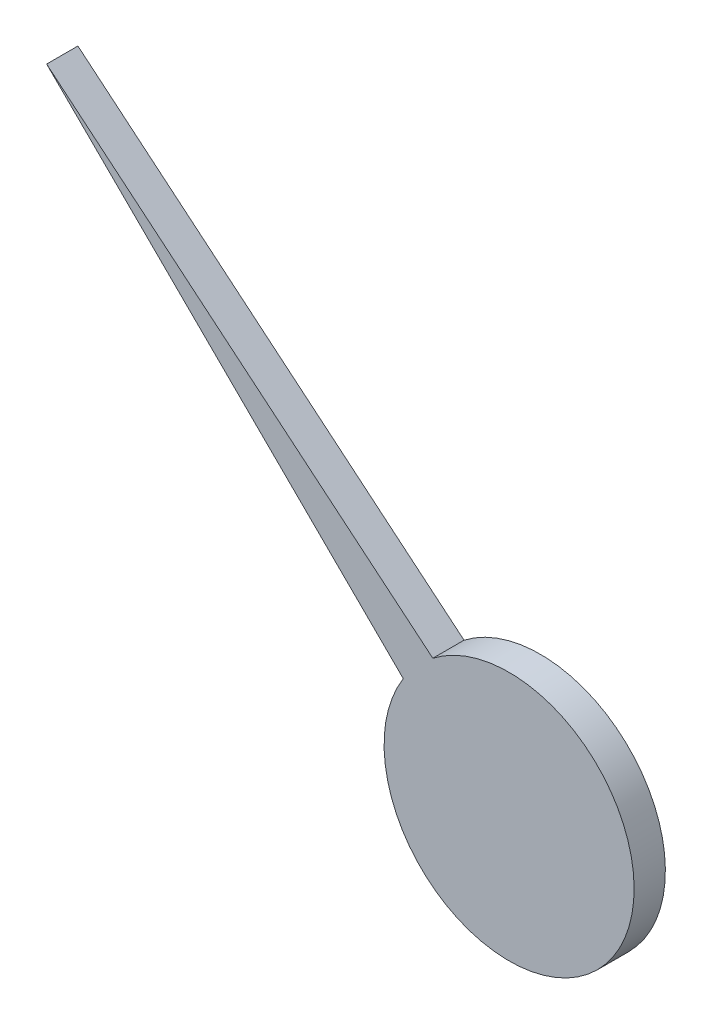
from build123d import *

# Parameters (mm, degrees)
LINEAR_AUSTRAGEN4_DEPTH = 0.25


with BuildPart() as part:
    # Skizze7 → Linear austragen4 (new body)
    with BuildSketch(Plane.XY):
        with BuildLine():
            Line((-3.699257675, 3.363850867), (-0.84634242, 0.532639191))
            ThreePointArc((-0.84634242, 0.532639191), (0.739851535, -0.672770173), (-0.610442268, 0.792060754))
            Line((-0.610442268, 0.792060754), (-3.699257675, 3.363850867))
        make_face()
    extrude(amount=LINEAR_AUSTRAGEN4_DEPTH)


solid = part.part
